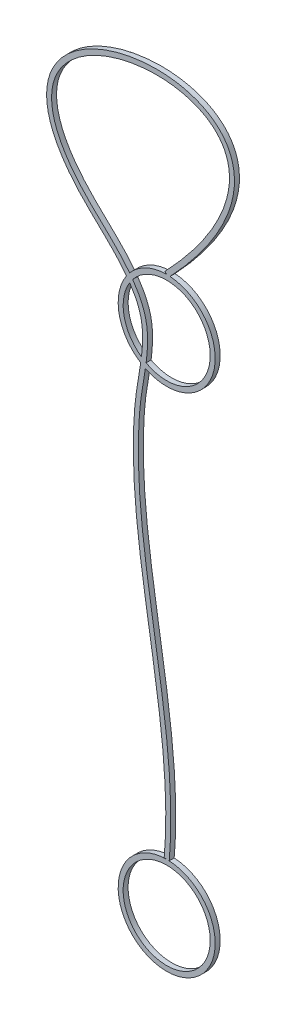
ISO-10303-21;
HEADER;
FILE_DESCRIPTION(('STEP AP214'),'2;1');
FILE_NAME('part.step','',(''),(''),'','','');
FILE_SCHEMA(('AUTOMOTIVE_DESIGN { 1 0 10303 214 1 1 1 1 }'));
ENDSEC;
DATA;
#1=APPLICATION_CONTEXT('core data for automotive mechanical design processes');
#2=APPLICATION_PROTOCOL_DEFINITION('international standard','automotive_design',2000,#1);
#3=PRODUCT_CONTEXT('',#1,'mechanical');
#4=PRODUCT('Part','Part','',(#3));
#5=PRODUCT_RELATED_PRODUCT_CATEGORY('part','',(#4));
#6=PRODUCT_DEFINITION_FORMATION('','',#4);
#7=PRODUCT_DEFINITION_CONTEXT('part definition',#1,'design');
#8=PRODUCT_DEFINITION('design','',#6,#7);
#9=PRODUCT_DEFINITION_SHAPE('','',#8);
#10=(LENGTH_UNIT() NAMED_UNIT(*) SI_UNIT(.MILLI.,.METRE.));
#11=(NAMED_UNIT(*) PLANE_ANGLE_UNIT() SI_UNIT($,.RADIAN.));
#12=(NAMED_UNIT(*) SI_UNIT($,.STERADIAN.) SOLID_ANGLE_UNIT());
#13=UNCERTAINTY_MEASURE_WITH_UNIT(LENGTH_MEASURE(1.E-05),#10,'distance_accuracy_value','');
#14=(GEOMETRIC_REPRESENTATION_CONTEXT(3) GLOBAL_UNCERTAINTY_ASSIGNED_CONTEXT((#13)) GLOBAL_UNIT_ASSIGNED_CONTEXT((#10,
#11,#12)) REPRESENTATION_CONTEXT('',''));
#15=CARTESIAN_POINT('',(0.,0.,0.));
#16=DIRECTION('',(0.,0.,1.));
#17=DIRECTION('',(1.,0.,0.));
#18=AXIS2_PLACEMENT_3D('',#15,#16,#17);
#19=CARTESIAN_POINT('',(-0.362690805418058,111.675423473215,0.5));
#20=CARTESIAN_POINT('',(4.5755259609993,116.879327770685,0.5));
#21=CARTESIAN_POINT('',(7.90134615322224,121.415668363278,0.5));
#22=CARTESIAN_POINT('',(10.9633305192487,127.254228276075,0.5));
#23=CARTESIAN_POINT('',(11.6629688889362,129.039011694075,0.5));
#24=CARTESIAN_POINT('',(12.5090141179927,132.290513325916,0.5));
#25=CARTESIAN_POINT('',(12.6556241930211,133.756632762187,0.5));
#26=CARTESIAN_POINT('',(12.4918650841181,136.385693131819,0.5));
#27=CARTESIAN_POINT('',(12.1825700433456,137.549070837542,0.5));
#28=CARTESIAN_POINT('',(11.1908159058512,139.608892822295,0.5));
#29=CARTESIAN_POINT('',(10.5074357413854,140.506582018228,0.5));
#30=CARTESIAN_POINT('',(8.82664482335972,142.05791487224,0.5));
#31=CARTESIAN_POINT('',(7.82864281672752,142.710770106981,0.5));
#32=CARTESIAN_POINT('',(5.58846655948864,143.772554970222,0.5));
#33=CARTESIAN_POINT('',(4.34662931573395,144.181142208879,0.5));
#34=CARTESIAN_POINT('',(0.377793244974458,145.043573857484,0.5));
#35=CARTESIAN_POINT('',(-2.59188623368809,145.132899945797,0.5));
#36=CARTESIAN_POINT('',(-8.5094384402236,144.402679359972,0.5));
#37=CARTESIAN_POINT('',(-11.4571166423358,143.583517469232,0.5));
#38=CARTESIAN_POINT('',(-16.6665623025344,141.130240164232,0.5));
#39=CARTESIAN_POINT('',(-18.9257149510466,139.49652964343,0.5));
#40=CARTESIAN_POINT('',(-21.3261706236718,136.528081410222,0.5));
#41=CARTESIAN_POINT('',(-21.9624799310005,135.452809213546,0.5));
#42=CARTESIAN_POINT('',(-22.8394842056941,133.137253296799,0.5));
#43=CARTESIAN_POINT('',(-23.0809554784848,131.896694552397,0.5));
#44=CARTESIAN_POINT('',(-23.0940283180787,129.241085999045,0.5));
#45=CARTESIAN_POINT('',(-22.8652479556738,127.825166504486,0.5));
#46=CARTESIAN_POINT('',(-21.8447508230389,124.814946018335,0.5));
#47=CARTESIAN_POINT('',(-21.0525203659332,123.220963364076,0.5));
#48=CARTESIAN_POINT('',(-19.3730158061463,120.705822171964,0.5));
#49=CARTESIAN_POINT('',(-18.7313818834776,119.84681866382,0.5));
#50=CARTESIAN_POINT('',(-17.2738166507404,118.089490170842,0.5));
#51=CARTESIAN_POINT('',(-16.4580346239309,117.19233878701,0.5));
#52=CARTESIAN_POINT('',(-13.7324865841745,114.437000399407,0.5));
#53=CARTESIAN_POINT('',(-11.5603170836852,112.503671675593,0.5));
#54=CARTESIAN_POINT('',(-8.59422053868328,109.33611634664,0.5));
#55=CARTESIAN_POINT('',(-7.65390124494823,108.234961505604,0.5));
#56=CARTESIAN_POINT('',(-6.00874558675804,105.914326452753,0.5));
#57=CARTESIAN_POINT('',(-5.30361505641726,104.694419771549,0.5));
#58=CARTESIAN_POINT('',(-4.53311754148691,102.755023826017,0.5));
#59=CARTESIAN_POINT('',(-4.32443108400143,102.089133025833,0.5));
#60=CARTESIAN_POINT('',(-4.02190992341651,100.724968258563,0.5));
#61=CARTESIAN_POINT('',(-3.92624684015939,100.029568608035,0.5));
#62=CARTESIAN_POINT('',(-3.77070529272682,97.9151951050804,0.5));
#63=CARTESIAN_POINT('',(-3.84176279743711,96.4680727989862,0.5));
#64=CARTESIAN_POINT('',(-4.15351897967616,93.5479187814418,0.5));
#65=CARTESIAN_POINT('',(-4.39447517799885,92.0745139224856,0.5));
#66=CARTESIAN_POINT('',(-4.75575277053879,89.8825860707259,0.5));
#67=CARTESIAN_POINT('',(-4.87619758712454,89.1550188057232,0.5));
#68=CARTESIAN_POINT('',(-5.09630377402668,87.7129899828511,0.5));
#69=CARTESIAN_POINT('',(-5.19499988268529,87.0000044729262,0.5));
#70=CARTESIAN_POINT('',(-5.43625822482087,84.8800855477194,0.5));
#71=CARTESIAN_POINT('',(-5.53362755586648,83.4843742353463,0.5));
#72=CARTESIAN_POINT('',(-5.66401469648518,80.6781517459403,0.5));
#73=CARTESIAN_POINT('',(-5.6931630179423,79.2727888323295,0.5));
#74=CARTESIAN_POINT('',(-5.67073204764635,66.6060838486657,0.5));
#75=CARTESIAN_POINT('',(-3.62213867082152,55.2149635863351,0.5));
#76=CARTESIAN_POINT('',(-0.0264938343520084,32.4114672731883,0.5));
#77=CARTESIAN_POINT('',(1.520885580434,20.9972819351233,0.5));
#78=CARTESIAN_POINT('',(0.497967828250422,9.68621621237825,0.5));
#79=B_SPLINE_CURVE_WITH_KNOTS('',3,(#19,#20,#21,#22,#23,#24,#25,#26,#27,#28,#29,#30,#31,#32,#33,
#34,#35,#36,#37,#38,#39,#40,#41,#42,#43,#44,#45,#46,#47,#48,#49,#50,#51,#52,#53,#54,#55,#56,#57,
#58,#59,#60,#61,#62,#63,#64,#65,#66,#67,#68,#69,#70,#71,#72,#73,#74,#75,#76,#77,#78),
.UNSPECIFIED.,.F.,.F.,(4,2,2,2,2,2,2,2,2,2,2,2,2,2,2,2,2,2,2,2,2,2,2,2,2,2,2,2,2,4),(0.,
0.0625000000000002,0.09375,0.125,0.15625,0.1875,0.21875,0.25,0.3125,0.374999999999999,
0.437499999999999,0.46875,0.5,0.53125,0.5625,0.578125,0.59375,0.625,0.640625,0.65625,0.6640625,
0.671875,0.6875,0.703125,0.7109375,0.71875,0.734374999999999,0.749999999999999,0.875,1.),.UNSPECIFIED.);
#80=DIRECTION('',(0.,0.,-1.));
#81=VECTOR('',#80,1.);
#82=SURFACE_OF_LINEAR_EXTRUSION('',#79,#81);
#83=CARTESIAN_POINT('',(-0.362690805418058,111.675423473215,0.5));
#84=VERTEX_POINT('',#83);
#85=CARTESIAN_POINT('',(-7.43042290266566,107.883792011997,0.5));
#86=VERTEX_POINT('',#85);
#87=EDGE_CURVE('E309',#84,#86,#79,.T.);
#88=ORIENTED_EDGE('',*,*,#87,.T.);
#89=DIRECTION('',(0.,0.,-1.));
#90=VECTOR('',#89,1.);
#91=CARTESIAN_POINT('',(-7.43042290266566,107.883792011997,0.5));
#92=LINE('',#91,#90);
#93=CARTESIAN_POINT('',(-7.43042290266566,107.883792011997,-0.5));
#94=VERTEX_POINT('',#93);
#95=EDGE_CURVE('E277',#86,#94,#92,.T.);
#96=ORIENTED_EDGE('',*,*,#95,.T.);
#97=CARTESIAN_POINT('',(-0.362690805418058,111.675423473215,-0.5));
#98=CARTESIAN_POINT('',(4.5755259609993,116.879327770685,-0.5));
#99=CARTESIAN_POINT('',(7.90134615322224,121.415668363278,-0.5));
#100=CARTESIAN_POINT('',(10.9633305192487,127.254228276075,-0.5));
#101=CARTESIAN_POINT('',(11.6629688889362,129.039011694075,-0.5));
#102=CARTESIAN_POINT('',(12.5090141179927,132.290513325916,-0.5));
#103=CARTESIAN_POINT('',(12.6556241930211,133.756632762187,-0.5));
#104=CARTESIAN_POINT('',(12.4918650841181,136.385693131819,-0.5));
#105=CARTESIAN_POINT('',(12.1825700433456,137.549070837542,-0.5));
#106=CARTESIAN_POINT('',(11.1908159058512,139.608892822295,-0.5));
#107=CARTESIAN_POINT('',(10.5074357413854,140.506582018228,-0.5));
#108=CARTESIAN_POINT('',(8.82664482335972,142.05791487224,-0.5));
#109=CARTESIAN_POINT('',(7.82864281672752,142.710770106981,-0.5));
#110=CARTESIAN_POINT('',(5.58846655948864,143.772554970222,-0.5));
#111=CARTESIAN_POINT('',(4.34662931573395,144.181142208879,-0.5));
#112=CARTESIAN_POINT('',(0.377793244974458,145.043573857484,-0.5));
#113=CARTESIAN_POINT('',(-2.59188623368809,145.132899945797,-0.5));
#114=CARTESIAN_POINT('',(-8.5094384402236,144.402679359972,-0.5));
#115=CARTESIAN_POINT('',(-11.4571166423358,143.583517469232,-0.5));
#116=CARTESIAN_POINT('',(-16.6665623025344,141.130240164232,-0.5));
#117=CARTESIAN_POINT('',(-18.9257149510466,139.49652964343,-0.5));
#118=CARTESIAN_POINT('',(-21.3261706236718,136.528081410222,-0.5));
#119=CARTESIAN_POINT('',(-21.9624799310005,135.452809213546,-0.5));
#120=CARTESIAN_POINT('',(-22.8394842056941,133.137253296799,-0.5));
#121=CARTESIAN_POINT('',(-23.0809554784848,131.896694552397,-0.5));
#122=CARTESIAN_POINT('',(-23.0940283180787,129.241085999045,-0.5));
#123=CARTESIAN_POINT('',(-22.8652479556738,127.825166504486,-0.5));
#124=CARTESIAN_POINT('',(-21.8447508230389,124.814946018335,-0.5));
#125=CARTESIAN_POINT('',(-21.0525203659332,123.220963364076,-0.5));
#126=CARTESIAN_POINT('',(-19.3730158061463,120.705822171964,-0.5));
#127=CARTESIAN_POINT('',(-18.7313818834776,119.84681866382,-0.5));
#128=CARTESIAN_POINT('',(-17.2738166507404,118.089490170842,-0.5));
#129=CARTESIAN_POINT('',(-16.4580346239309,117.19233878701,-0.5));
#130=CARTESIAN_POINT('',(-13.7324865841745,114.437000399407,-0.5));
#131=CARTESIAN_POINT('',(-11.5603170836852,112.503671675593,-0.5));
#132=CARTESIAN_POINT('',(-8.59422053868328,109.33611634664,-0.5));
#133=CARTESIAN_POINT('',(-7.65390124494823,108.234961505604,-0.5));
#134=CARTESIAN_POINT('',(-6.00874558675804,105.914326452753,-0.5));
#135=CARTESIAN_POINT('',(-5.30361505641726,104.694419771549,-0.5));
#136=CARTESIAN_POINT('',(-4.53311754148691,102.755023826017,-0.5));
#137=CARTESIAN_POINT('',(-4.32443108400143,102.089133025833,-0.5));
#138=CARTESIAN_POINT('',(-4.02190992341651,100.724968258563,-0.5));
#139=CARTESIAN_POINT('',(-3.92624684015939,100.029568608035,-0.5));
#140=CARTESIAN_POINT('',(-3.77070529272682,97.9151951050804,-0.5));
#141=CARTESIAN_POINT('',(-3.84176279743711,96.4680727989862,-0.5));
#142=CARTESIAN_POINT('',(-4.15351897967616,93.5479187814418,-0.5));
#143=CARTESIAN_POINT('',(-4.39447517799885,92.0745139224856,-0.5));
#144=CARTESIAN_POINT('',(-4.75575277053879,89.8825860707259,-0.5));
#145=CARTESIAN_POINT('',(-4.87619758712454,89.1550188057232,-0.5));
#146=CARTESIAN_POINT('',(-5.09630377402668,87.7129899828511,-0.5));
#147=CARTESIAN_POINT('',(-5.19499988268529,87.0000044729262,-0.5));
#148=CARTESIAN_POINT('',(-5.43625822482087,84.8800855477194,-0.5));
#149=CARTESIAN_POINT('',(-5.53362755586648,83.4843742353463,-0.5));
#150=CARTESIAN_POINT('',(-5.66401469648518,80.6781517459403,-0.5));
#151=CARTESIAN_POINT('',(-5.6931630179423,79.2727888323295,-0.5));
#152=CARTESIAN_POINT('',(-5.67073204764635,66.6060838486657,-0.5));
#153=CARTESIAN_POINT('',(-3.62213867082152,55.2149635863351,-0.5));
#154=CARTESIAN_POINT('',(-0.0264938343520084,32.4114672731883,-0.5));
#155=CARTESIAN_POINT('',(1.520885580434,20.9972819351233,-0.5));
#156=CARTESIAN_POINT('',(0.497967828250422,9.68621621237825,-0.5));
#157=B_SPLINE_CURVE_WITH_KNOTS('',3,(#97,#98,#99,#100,#101,#102,#103,#104,#105,#106,#107,#108,
#109,#110,#111,#112,#113,#114,#115,#116,#117,#118,#119,#120,#121,#122,#123,#124,#125,#126,#127,
#128,#129,#130,#131,#132,#133,#134,#135,#136,#137,#138,#139,#140,#141,#142,#143,#144,#145,#146,
#147,#148,#149,#150,#151,#152,#153,#154,#155,#156),.UNSPECIFIED.,.F.,.F.,(4,2,2,2,2,2,2,2,2,2,2,
2,2,2,2,2,2,2,2,2,2,2,2,2,2,2,2,2,2,4),(0.,0.0625000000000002,0.09375,0.125,0.15625,0.1875,
0.21875,0.25,0.3125,0.374999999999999,0.437499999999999,0.46875,0.5,0.53125,0.5625,0.578125,
0.59375,0.625,0.640625,0.65625,0.6640625,0.671875,0.6875,0.703125,0.7109375,0.71875,
0.734374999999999,0.749999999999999,0.875,1.),.UNSPECIFIED.);
#158=CARTESIAN_POINT('',(-0.362690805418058,111.675423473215,-0.5));
#159=VERTEX_POINT('',#158);
#160=EDGE_CURVE('E196',#159,#94,#157,.T.);
#161=ORIENTED_EDGE('',*,*,#160,.F.);
#162=DIRECTION('',(0.,0.,-1.));
#163=VECTOR('',#162,1.);
#164=CARTESIAN_POINT('',(-0.362690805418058,111.675423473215,0.5));
#165=LINE('',#164,#163);
#166=EDGE_CURVE('E210',#84,#159,#165,.T.);
#167=ORIENTED_EDGE('',*,*,#166,.F.);
#168=EDGE_LOOP('',(#88,#96,#161,#167));
#169=FACE_BOUND('',#168,.T.);
#170=ADVANCED_FACE('F36',(#169),#82,.T.);
#171=CARTESIAN_POINT('',(-4.27742101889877,92.85923939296,-0.5));
#172=VERTEX_POINT('',#171);
#173=CARTESIAN_POINT('',(0.500867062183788,9.71835164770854,-0.5));
#174=VERTEX_POINT('',#173);
#175=EDGE_CURVE('E205',#172,#174,#157,.T.);
#176=ORIENTED_EDGE('',*,*,#175,.F.);
#177=DIRECTION('',(0.,0.,-1.));
#178=VECTOR('',#177,1.);
#179=CARTESIAN_POINT('',(-4.27742101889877,92.85923939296,0.5));
#180=LINE('',#179,#178);
#181=CARTESIAN_POINT('',(-4.27742101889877,92.85923939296,0.5));
#182=VERTEX_POINT('',#181);
#183=EDGE_CURVE('E54',#172,#182,#180,.F.);
#184=ORIENTED_EDGE('',*,*,#183,.T.);
#185=CARTESIAN_POINT('',(0.500867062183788,9.71835164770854,0.5));
#186=VERTEX_POINT('',#185);
#187=EDGE_CURVE('E170',#182,#186,#79,.T.);
#188=ORIENTED_EDGE('',*,*,#187,.T.);
#189=DIRECTION('',(0.,0.,-1.));
#190=VECTOR('',#189,1.);
#191=CARTESIAN_POINT('',(0.500867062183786,9.71835164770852,0.5));
#192=LINE('',#191,#190);
#193=EDGE_CURVE('E228',#174,#186,#192,.F.);
#194=ORIENTED_EDGE('',*,*,#193,.F.);
#195=EDGE_LOOP('',(#176,#184,#188,#194));
#196=FACE_BOUND('',#195,.T.);
#197=ADVANCED_FACE('F324',(#196),#82,.T.);
#198=CARTESIAN_POINT('',(0.362690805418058,110.987076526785,0.5));
#199=CARTESIAN_POINT('',(5.34622723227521,116.23873878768,0.5));
#200=CARTESIAN_POINT('',(8.72802714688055,120.838873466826,0.5));
#201=CARTESIAN_POINT('',(11.8783919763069,126.845956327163,0.5));
#202=CARTESIAN_POINT('',(12.6080231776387,128.699875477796,0.5));
#203=CARTESIAN_POINT('',(13.4995098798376,132.126016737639,0.5));
#204=CARTESIAN_POINT('',(13.6611621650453,133.698837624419,0.5));
#205=CARTESIAN_POINT('',(13.4824585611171,136.567823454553,0.5));
#206=CARTESIAN_POINT('',(13.1410285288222,137.863551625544,0.5));
#207=CARTESIAN_POINT('',(12.0343648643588,140.162034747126,0.5));
#208=CARTESIAN_POINT('',(11.2700522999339,141.163544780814,0.5));
#209=CARTESIAN_POINT('',(9.42050988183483,142.870631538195,0.5));
#210=CARTESIAN_POINT('',(8.33587128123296,143.576996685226,0.5));
#211=CARTESIAN_POINT('',(5.93783822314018,144.713601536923,0.5));
#212=CARTESIAN_POINT('',(4.6241067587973,145.144183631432,0.5));
#213=CARTESIAN_POINT('',(0.459874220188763,146.049075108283,0.5));
#214=CARTESIAN_POINT('',(-2.61430868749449,146.137717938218,0.5));
#215=CARTESIAN_POINT('',(-8.73195632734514,145.382805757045,0.5));
#216=CARTESIAN_POINT('',(-11.7756155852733,144.538865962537,0.5));
#217=CARTESIAN_POINT('',(-17.2001616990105,141.984291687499,0.5));
#218=CARTESIAN_POINT('',(-19.5836633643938,140.27325231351,0.5));
#219=CARTESIAN_POINT('',(-22.1635581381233,137.082906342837,0.5));
#220=CARTESIAN_POINT('',(-22.8567604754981,135.91496891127,0.5));
#221=CARTESIAN_POINT('',(-23.8155493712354,133.383476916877,0.5));
#222=CARTESIAN_POINT('',(-24.0803596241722,132.020197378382,0.5));
#223=CARTESIAN_POINT('',(-24.0945999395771,129.12742851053,0.5));
#224=CARTESIAN_POINT('',(-23.8444119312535,127.598808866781,0.5));
#225=CARTESIAN_POINT('',(-22.7597026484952,124.399178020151,0.5));
#226=CARTESIAN_POINT('',(-21.9256950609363,122.727848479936,0.5));
#227=CARTESIAN_POINT('',(-20.1838754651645,120.119387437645,0.5));
#228=CARTESIAN_POINT('',(-19.52140682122,119.232917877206,0.5));
#229=CARTESIAN_POINT('',(-18.0231920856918,117.426579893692,0.5));
#230=CARTESIAN_POINT('',(-17.1855183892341,116.505810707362,0.5));
#231=CARTESIAN_POINT('',(-14.4103379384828,113.700297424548,0.5));
#232=CARTESIAN_POINT('',(-12.2483446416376,111.775401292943,0.5));
#233=CARTESIAN_POINT('',(-9.34511371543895,108.674981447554,0.5));
#234=CARTESIAN_POINT('',(-8.43430997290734,107.606704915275,0.5));
#235=CARTESIAN_POINT('',(-6.85993053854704,105.385905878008,0.5));
#236=CARTESIAN_POINT('',(-6.19664901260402,104.23380984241,0.5));
#237=CARTESIAN_POINT('',(-5.4806157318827,102.431504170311,0.5));
#238=CARTESIAN_POINT('',(-5.28889909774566,101.819357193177,0.5));
#239=CARTESIAN_POINT('',(-5.01000575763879,100.561737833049,0.5));
#240=CARTESIAN_POINT('',(-4.92047851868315,99.9144238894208,0.5));
#241=CARTESIAN_POINT('',(-4.77415726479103,97.9253876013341,0.5));
#242=CARTESIAN_POINT('',(-4.84013544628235,96.5365447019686,0.5));
#243=CARTESIAN_POINT('',(-5.14384510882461,93.6917607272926,0.5));
#244=CARTESIAN_POINT('',(-5.38131906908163,92.2361927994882,0.5));
#245=CARTESIAN_POINT('',(-5.86270976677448,89.3155198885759,0.5));
#246=CARTESIAN_POINT('',(-6.104890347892,87.8485098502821,0.5));
#247=CARTESIAN_POINT('',(-6.43312109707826,84.9643709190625,0.5));
#248=CARTESIAN_POINT('',(-6.53175439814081,83.547908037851,0.5));
#249=CARTESIAN_POINT('',(-6.66373247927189,80.7074449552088,0.5));
#250=CARTESIAN_POINT('',(-6.69318798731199,79.2860035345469,0.5));
#251=CARTESIAN_POINT('',(-6.67051818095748,66.4844285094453,0.5));
#252=CARTESIAN_POINT('',(-4.6076602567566,55.0447860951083,0.5));
#253=CARTESIAN_POINT('',(-1.01656362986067,32.2701344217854,0.5));
#254=CARTESIAN_POINT('',(0.511347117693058,20.9369344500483,0.5));
#255=CARTESIAN_POINT('',(-0.497967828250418,9.77628378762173,0.5));
#256=B_SPLINE_CURVE_WITH_KNOTS('',3,(#198,#199,#200,#201,#202,#203,#204,#205,#206,#207,#208,
#209,#210,#211,#212,#213,#214,#215,#216,#217,#218,#219,#220,#221,#222,#223,#224,#225,#226,#227,
#228,#229,#230,#231,#232,#233,#234,#235,#236,#237,#238,#239,#240,#241,#242,#243,#244,#245,#246,
#247,#248,#249,#250,#251,#252,#253,#254,#255),.UNSPECIFIED.,.F.,.F.,(4,2,2,2,2,2,2,2,2,2,2,2,2,
2,2,2,2,2,2,2,2,2,2,2,2,2,2,2,4),(0.,0.0625000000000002,0.0937500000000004,0.125,
0.156250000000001,0.187500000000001,0.218750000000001,0.250000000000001,0.312500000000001,
0.375000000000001,0.437500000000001,0.468750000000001,0.500000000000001,0.531250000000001,
0.562500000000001,0.578125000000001,0.593750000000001,0.625000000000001,0.640625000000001,
0.656250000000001,0.664062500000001,0.671875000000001,0.687500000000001,0.703125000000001,
0.718750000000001,0.734375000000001,0.750000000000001,0.875000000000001,1.),.UNSPECIFIED.);
#257=DIRECTION('',(0.,0.,-1.));
#258=VECTOR('',#257,1.);
#259=SURFACE_OF_LINEAR_EXTRUSION('',#256,#258);
#260=DIRECTION('',(0.,0.,-1.));
#261=VECTOR('',#260,1.);
#262=CARTESIAN_POINT('',(0.666383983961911,111.308406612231,0.5));
#263=LINE('',#262,#261);
#264=CARTESIAN_POINT('',(0.666383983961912,111.308406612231,-0.5));
#265=VERTEX_POINT('',#264);
#266=CARTESIAN_POINT('',(0.666383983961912,111.308406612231,0.5));
#267=VERTEX_POINT('',#266);
#268=EDGE_CURVE('E151',#265,#267,#263,.F.);
#269=ORIENTED_EDGE('',*,*,#268,.F.);
#270=CARTESIAN_POINT('',(0.362690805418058,110.987076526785,-0.5));
#271=CARTESIAN_POINT('',(5.34622723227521,116.23873878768,-0.5));
#272=CARTESIAN_POINT('',(8.72802714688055,120.838873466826,-0.5));
#273=CARTESIAN_POINT('',(11.8783919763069,126.845956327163,-0.5));
#274=CARTESIAN_POINT('',(12.6080231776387,128.699875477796,-0.5));
#275=CARTESIAN_POINT('',(13.4995098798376,132.126016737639,-0.5));
#276=CARTESIAN_POINT('',(13.6611621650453,133.698837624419,-0.5));
#277=CARTESIAN_POINT('',(13.4824585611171,136.567823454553,-0.5));
#278=CARTESIAN_POINT('',(13.1410285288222,137.863551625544,-0.5));
#279=CARTESIAN_POINT('',(12.0343648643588,140.162034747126,-0.5));
#280=CARTESIAN_POINT('',(11.2700522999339,141.163544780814,-0.5));
#281=CARTESIAN_POINT('',(9.42050988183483,142.870631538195,-0.5));
#282=CARTESIAN_POINT('',(8.33587128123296,143.576996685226,-0.5));
#283=CARTESIAN_POINT('',(5.93783822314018,144.713601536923,-0.5));
#284=CARTESIAN_POINT('',(4.6241067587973,145.144183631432,-0.5));
#285=CARTESIAN_POINT('',(0.459874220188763,146.049075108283,-0.5));
#286=CARTESIAN_POINT('',(-2.61430868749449,146.137717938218,-0.5));
#287=CARTESIAN_POINT('',(-8.73195632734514,145.382805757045,-0.5));
#288=CARTESIAN_POINT('',(-11.7756155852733,144.538865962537,-0.5));
#289=CARTESIAN_POINT('',(-17.2001616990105,141.984291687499,-0.5));
#290=CARTESIAN_POINT('',(-19.5836633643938,140.27325231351,-0.5));
#291=CARTESIAN_POINT('',(-22.1635581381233,137.082906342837,-0.5));
#292=CARTESIAN_POINT('',(-22.8567604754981,135.91496891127,-0.5));
#293=CARTESIAN_POINT('',(-23.8155493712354,133.383476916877,-0.5));
#294=CARTESIAN_POINT('',(-24.0803596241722,132.020197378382,-0.5));
#295=CARTESIAN_POINT('',(-24.0945999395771,129.12742851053,-0.5));
#296=CARTESIAN_POINT('',(-23.8444119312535,127.598808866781,-0.5));
#297=CARTESIAN_POINT('',(-22.7597026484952,124.399178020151,-0.5));
#298=CARTESIAN_POINT('',(-21.9256950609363,122.727848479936,-0.5));
#299=CARTESIAN_POINT('',(-20.1838754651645,120.119387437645,-0.5));
#300=CARTESIAN_POINT('',(-19.52140682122,119.232917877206,-0.5));
#301=CARTESIAN_POINT('',(-18.0231920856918,117.426579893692,-0.5));
#302=CARTESIAN_POINT('',(-17.1855183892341,116.505810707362,-0.5));
#303=CARTESIAN_POINT('',(-14.4103379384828,113.700297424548,-0.5));
#304=CARTESIAN_POINT('',(-12.2483446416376,111.775401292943,-0.5));
#305=CARTESIAN_POINT('',(-9.34511371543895,108.674981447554,-0.5));
#306=CARTESIAN_POINT('',(-8.43430997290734,107.606704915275,-0.5));
#307=CARTESIAN_POINT('',(-6.85993053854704,105.385905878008,-0.5));
#308=CARTESIAN_POINT('',(-6.19664901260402,104.23380984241,-0.5));
#309=CARTESIAN_POINT('',(-5.4806157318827,102.431504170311,-0.5));
#310=CARTESIAN_POINT('',(-5.28889909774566,101.819357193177,-0.5));
#311=CARTESIAN_POINT('',(-5.01000575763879,100.561737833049,-0.5));
#312=CARTESIAN_POINT('',(-4.92047851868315,99.9144238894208,-0.5));
#313=CARTESIAN_POINT('',(-4.77415726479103,97.9253876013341,-0.5));
#314=CARTESIAN_POINT('',(-4.84013544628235,96.5365447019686,-0.5));
#315=CARTESIAN_POINT('',(-5.14384510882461,93.6917607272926,-0.5));
#316=CARTESIAN_POINT('',(-5.38131906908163,92.2361927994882,-0.5));
#317=CARTESIAN_POINT('',(-5.86270976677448,89.3155198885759,-0.5));
#318=CARTESIAN_POINT('',(-6.104890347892,87.8485098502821,-0.5));
#319=CARTESIAN_POINT('',(-6.43312109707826,84.9643709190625,-0.5));
#320=CARTESIAN_POINT('',(-6.53175439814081,83.547908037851,-0.5));
#321=CARTESIAN_POINT('',(-6.66373247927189,80.7074449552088,-0.5));
#322=CARTESIAN_POINT('',(-6.69318798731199,79.2860035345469,-0.5));
#323=CARTESIAN_POINT('',(-6.67051818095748,66.4844285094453,-0.5));
#324=CARTESIAN_POINT('',(-4.6076602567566,55.0447860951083,-0.5));
#325=CARTESIAN_POINT('',(-1.01656362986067,32.2701344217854,-0.5));
#326=CARTESIAN_POINT('',(0.511347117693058,20.9369344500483,-0.5));
#327=CARTESIAN_POINT('',(-0.497967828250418,9.77628378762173,-0.5));
#328=B_SPLINE_CURVE_WITH_KNOTS('',3,(#270,#271,#272,#273,#274,#275,#276,#277,#278,#279,#280,
#281,#282,#283,#284,#285,#286,#287,#288,#289,#290,#291,#292,#293,#294,#295,#296,#297,#298,#299,
#300,#301,#302,#303,#304,#305,#306,#307,#308,#309,#310,#311,#312,#313,#314,#315,#316,#317,#318,
#319,#320,#321,#322,#323,#324,#325,#326,#327),.UNSPECIFIED.,.F.,.F.,(4,2,2,2,2,2,2,2,2,2,2,2,2,
2,2,2,2,2,2,2,2,2,2,2,2,2,2,2,4),(0.,0.0625000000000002,0.0937500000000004,0.125,
0.156250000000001,0.187500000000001,0.218750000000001,0.250000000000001,0.312500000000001,
0.375000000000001,0.437500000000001,0.468750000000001,0.500000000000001,0.531250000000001,
0.562500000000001,0.578125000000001,0.593750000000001,0.625000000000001,0.640625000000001,
0.656250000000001,0.664062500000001,0.671875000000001,0.687500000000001,0.703125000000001,
0.718750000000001,0.734375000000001,0.750000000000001,0.875000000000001,1.),.UNSPECIFIED.);
#329=CARTESIAN_POINT('',(-8.05732602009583,107.05680528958,-0.5));
#330=VERTEX_POINT('',#329);
#331=EDGE_CURVE('E286',#265,#330,#328,.T.);
#332=ORIENTED_EDGE('',*,*,#331,.T.);
#333=DIRECTION('',(0.,0.,-1.));
#334=VECTOR('',#333,1.);
#335=CARTESIAN_POINT('',(-8.05732602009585,107.05680528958,0.5));
#336=LINE('',#335,#334);
#337=CARTESIAN_POINT('',(-8.05732602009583,107.05680528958,0.5));
#338=VERTEX_POINT('',#337);
#339=EDGE_CURVE('E161',#338,#330,#336,.T.);
#340=ORIENTED_EDGE('',*,*,#339,.F.);
#341=EDGE_CURVE('E168',#267,#338,#256,.T.);
#342=ORIENTED_EDGE('',*,*,#341,.F.);
#343=EDGE_LOOP('',(#269,#332,#340,#342));
#344=FACE_BOUND('',#343,.T.);
#345=ADVANCED_FACE('F177',(#344),#259,.F.);
#346=DIRECTION('',(0.,0.,-1.));
#347=VECTOR('',#346,1.);
#348=CARTESIAN_POINT('',(-5.21164752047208,93.3819736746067,0.5));
#349=LINE('',#348,#347);
#350=CARTESIAN_POINT('',(-5.21164752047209,93.3819736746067,-0.5));
#351=VERTEX_POINT('',#350);
#352=CARTESIAN_POINT('',(-5.21164752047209,93.3819736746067,0.5));
#353=VERTEX_POINT('',#352);
#354=EDGE_CURVE('E271',#351,#353,#349,.F.);
#355=ORIENTED_EDGE('',*,*,#354,.F.);
#356=CARTESIAN_POINT('',(-0.497967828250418,9.77628378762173,-0.5));
#357=VERTEX_POINT('',#356);
#358=EDGE_CURVE('E281',#351,#357,#328,.T.);
#359=ORIENTED_EDGE('',*,*,#358,.T.);
#360=DIRECTION('',(0.,0.,-1.));
#361=VECTOR('',#360,1.);
#362=CARTESIAN_POINT('',(-0.497967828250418,9.77628378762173,0.5));
#363=LINE('',#362,#361);
#364=CARTESIAN_POINT('',(-0.497967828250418,9.77628378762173,0.5));
#365=VERTEX_POINT('',#364);
#366=EDGE_CURVE('E212',#365,#357,#363,.T.);
#367=ORIENTED_EDGE('',*,*,#366,.F.);
#368=EDGE_CURVE('E181',#353,#365,#256,.T.);
#369=ORIENTED_EDGE('',*,*,#368,.F.);
#370=EDGE_LOOP('',(#355,#359,#367,#369));
#371=FACE_BOUND('',#370,.T.);
#372=ADVANCED_FACE('F333',(#371),#259,.F.);
#373=CARTESIAN_POINT('',(0.362690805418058,110.987076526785,0.5));
#374=DIRECTION('',(-0.688346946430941,-0.725381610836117,0.));
#375=DIRECTION('',(0.725381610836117,-0.688346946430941,0.));
#376=AXIS2_PLACEMENT_3D('',#373,#374,#375);
#377=PLANE('',#376);
#378=DIRECTION('',(-0.725381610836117,0.688346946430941,0.));
#379=VECTOR('',#378,1.);
#380=CARTESIAN_POINT('',(0.362690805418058,110.987076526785,-0.5));
#381=LINE('',#380,#379);
#382=CARTESIAN_POINT('',(0.,111.33125,-0.5));
#383=VERTEX_POINT('',#382);
#384=EDGE_CURVE('E192',#383,#159,#381,.T.);
#385=ORIENTED_EDGE('',*,*,#384,.F.);
#386=DIRECTION('',(0.,0.,-1.));
#387=VECTOR('',#386,1.);
#388=CARTESIAN_POINT('',(0.,111.33125,0.5));
#389=LINE('',#388,#387);
#390=CARTESIAN_POINT('',(0.,111.33125,0.5));
#391=VERTEX_POINT('',#390);
#392=EDGE_CURVE('E239',#383,#391,#389,.F.);
#393=ORIENTED_EDGE('',*,*,#392,.T.);
#394=DIRECTION('',(-0.725381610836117,0.688346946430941,0.));
#395=VECTOR('',#394,1.);
#396=CARTESIAN_POINT('',(0.362690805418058,110.987076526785,0.5));
#397=LINE('',#396,#395);
#398=EDGE_CURVE('E213',#391,#84,#397,.T.);
#399=ORIENTED_EDGE('',*,*,#398,.T.);
#400=ORIENTED_EDGE('',*,*,#166,.T.);
#401=EDGE_LOOP('',(#385,#393,#399,#400));
#402=FACE_BOUND('',#401,.T.);
#403=ADVANCED_FACE('F325',(#402),#377,.T.);
#404=CARTESIAN_POINT('',(0.,0.,0.5));
#405=DIRECTION('',(0.,0.,1.));
#406=DIRECTION('',(1.,0.,0.));
#407=AXIS2_PLACEMENT_3D('',#404,#405,#406);
#408=PLANE('',#407);
#409=CARTESIAN_POINT('',(0.,101.6,0.5));
#410=DIRECTION('',(0.,0.,1.));
#411=DIRECTION('',(1.,0.,0.));
#412=AXIS2_PLACEMENT_3D('',#409,#410,#411);
#413=CIRCLE('',#412,9.73125);
#414=EDGE_CURVE('E175',#391,#86,#413,.T.);
#415=ORIENTED_EDGE('',*,*,#414,.T.);
#416=ORIENTED_EDGE('',*,*,#87,.F.);
#417=ORIENTED_EDGE('',*,*,#398,.F.);
#418=EDGE_LOOP('',(#415,#416,#417));
#419=FACE_BOUND('',#418,.T.);
#420=CARTESIAN_POINT('',(-7.43049434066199,106.185027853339,0.5));
#421=VERTEX_POINT('',#420);
#422=CARTESIAN_POINT('',(-5.0639486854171,94.487254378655,0.5));
#423=VERTEX_POINT('',#422);
#424=EDGE_CURVE('E179',#421,#423,#256,.T.);
#425=ORIENTED_EDGE('',*,*,#424,.T.);
#426=CARTESIAN_POINT('',(0.,101.6,0.5));
#427=DIRECTION('',(0.,0.,1.));
#428=DIRECTION('',(1.,0.,0.));
#429=AXIS2_PLACEMENT_3D('',#426,#427,#428);
#430=CIRCLE('',#429,8.73125);
#431=EDGE_CURVE('E255',#421,#423,#430,.T.);
#432=ORIENTED_EDGE('',*,*,#431,.F.);
#433=EDGE_LOOP('',(#425,#432));
#434=FACE_BOUND('',#433,.T.);
#435=CARTESIAN_POINT('',(-4.12966240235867,93.9071062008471,0.5));
#436=VERTEX_POINT('',#435);
#437=CARTESIAN_POINT('',(-6.81743278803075,107.055028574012,0.5));
#438=VERTEX_POINT('',#437);
#439=EDGE_CURVE('E257',#436,#438,#430,.T.);
#440=ORIENTED_EDGE('',*,*,#439,.F.);
#441=EDGE_CURVE('E307',#438,#436,#79,.T.);
#442=ORIENTED_EDGE('',*,*,#441,.F.);
#443=EDGE_LOOP('',(#440,#442));
#444=FACE_BOUND('',#443,.T.);
#445=EDGE_CURVE('E154',#182,#267,#413,.T.);
#446=ORIENTED_EDGE('',*,*,#445,.T.);
#447=ORIENTED_EDGE('',*,*,#341,.T.);
#448=EDGE_CURVE('E172',#338,#353,#413,.T.);
#449=ORIENTED_EDGE('',*,*,#448,.T.);
#450=ORIENTED_EDGE('',*,*,#368,.T.);
#451=DIRECTION('',(-0.99593565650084,0.0900675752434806,0.));
#452=VECTOR('',#451,1.);
#453=CARTESIAN_POINT('',(0.497967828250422,9.68621621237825,0.5));
#454=LINE('',#453,#452);
#455=CARTESIAN_POINT('',(0.,9.73125,0.5));
#456=VERTEX_POINT('',#455);
#457=EDGE_CURVE('E178',#456,#365,#454,.T.);
#458=ORIENTED_EDGE('',*,*,#457,.F.);
#459=CARTESIAN_POINT('',(0.,0.,0.5));
#460=DIRECTION('',(0.,0.,1.));
#461=DIRECTION('',(1.,0.,0.));
#462=AXIS2_PLACEMENT_3D('',#459,#460,#461);
#463=CIRCLE('',#462,9.73125);
#464=EDGE_CURVE('E225',#456,#186,#463,.T.);
#465=ORIENTED_EDGE('',*,*,#464,.T.);
#466=ORIENTED_EDGE('',*,*,#187,.F.);
#467=EDGE_LOOP('',(#446,#447,#449,#450,#458,#465,#466));
#468=FACE_BOUND('',#467,.T.);
#469=CARTESIAN_POINT('',(0.,0.,0.5));
#470=DIRECTION('',(0.,0.,1.));
#471=DIRECTION('',(1.,0.,0.));
#472=AXIS2_PLACEMENT_3D('',#469,#470,#471);
#473=CIRCLE('',#472,8.73125);
#474=CARTESIAN_POINT('',(8.73125,0.,0.5));
#475=VERTEX_POINT('',#474);
#476=EDGE_CURVE('E217',#475,#475,#473,.T.);
#477=ORIENTED_EDGE('',*,*,#476,.F.);
#478=EDGE_LOOP('',(#477));
#479=FACE_BOUND('',#478,.T.);
#480=ADVANCED_FACE('F165',(#419,#434,#444,#468,#479),#408,.T.);
#481=CARTESIAN_POINT('',(0.,0.,-0.5));
#482=DIRECTION('',(0.,0.,1.));
#483=DIRECTION('',(1.,0.,0.));
#484=AXIS2_PLACEMENT_3D('',#481,#482,#483);
#485=PLANE('',#484);
#486=ORIENTED_EDGE('',*,*,#160,.T.);
#487=CARTESIAN_POINT('',(0.,101.6,-0.5));
#488=DIRECTION('',(0.,0.,1.));
#489=DIRECTION('',(1.,0.,0.));
#490=AXIS2_PLACEMENT_3D('',#487,#488,#489);
#491=CIRCLE('',#490,9.73125);
#492=EDGE_CURVE('E173',#383,#94,#491,.T.);
#493=ORIENTED_EDGE('',*,*,#492,.F.);
#494=ORIENTED_EDGE('',*,*,#384,.T.);
#495=EDGE_LOOP('',(#486,#493,#494));
#496=FACE_BOUND('',#495,.T.);
#497=CARTESIAN_POINT('',(0.,101.6,-0.5));
#498=DIRECTION('',(0.,0.,1.));
#499=DIRECTION('',(1.,0.,0.));
#500=AXIS2_PLACEMENT_3D('',#497,#498,#499);
#501=CIRCLE('',#500,8.73125);
#502=CARTESIAN_POINT('',(-7.430494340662,106.185027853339,-0.5));
#503=VERTEX_POINT('',#502);
#504=CARTESIAN_POINT('',(-5.0639486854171,94.487254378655,-0.5));
#505=VERTEX_POINT('',#504);
#506=EDGE_CURVE('E265',#503,#505,#501,.T.);
#507=ORIENTED_EDGE('',*,*,#506,.T.);
#508=EDGE_CURVE('E249',#503,#505,#328,.T.);
#509=ORIENTED_EDGE('',*,*,#508,.F.);
#510=EDGE_LOOP('',(#507,#509));
#511=FACE_BOUND('',#510,.T.);
#512=CARTESIAN_POINT('',(-6.81743278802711,107.055028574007,-0.5));
#513=VERTEX_POINT('',#512);
#514=CARTESIAN_POINT('',(-4.12966240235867,93.9071062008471,-0.5));
#515=VERTEX_POINT('',#514);
#516=EDGE_CURVE('E203',#513,#515,#157,.T.);
#517=ORIENTED_EDGE('',*,*,#516,.T.);
#518=EDGE_CURVE('E267',#515,#513,#501,.T.);
#519=ORIENTED_EDGE('',*,*,#518,.T.);
#520=EDGE_LOOP('',(#517,#519));
#521=FACE_BOUND('',#520,.T.);
#522=EDGE_CURVE('E261',#330,#351,#491,.T.);
#523=ORIENTED_EDGE('',*,*,#522,.F.);
#524=ORIENTED_EDGE('',*,*,#331,.F.);
#525=EDGE_CURVE('E156',#172,#265,#491,.T.);
#526=ORIENTED_EDGE('',*,*,#525,.F.);
#527=ORIENTED_EDGE('',*,*,#175,.T.);
#528=CARTESIAN_POINT('',(0.,0.,-0.5));
#529=DIRECTION('',(0.,0.,1.));
#530=DIRECTION('',(1.,0.,0.));
#531=AXIS2_PLACEMENT_3D('',#528,#529,#530);
#532=CIRCLE('',#531,9.73125);
#533=CARTESIAN_POINT('',(0.,9.73125,-0.5));
#534=VERTEX_POINT('',#533);
#535=EDGE_CURVE('E221',#534,#174,#532,.T.);
#536=ORIENTED_EDGE('',*,*,#535,.F.);
#537=DIRECTION('',(-0.99593565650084,0.0900675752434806,0.));
#538=VECTOR('',#537,1.);
#539=CARTESIAN_POINT('',(0.497967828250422,9.68621621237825,-0.5));
#540=LINE('',#539,#538);
#541=EDGE_CURVE('E297',#534,#357,#540,.T.);
#542=ORIENTED_EDGE('',*,*,#541,.T.);
#543=ORIENTED_EDGE('',*,*,#358,.F.);
#544=EDGE_LOOP('',(#523,#524,#526,#527,#536,#542,#543));
#545=FACE_BOUND('',#544,.T.);
#546=CARTESIAN_POINT('',(0.,0.,-0.5));
#547=DIRECTION('',(0.,0.,1.));
#548=DIRECTION('',(1.,0.,0.));
#549=AXIS2_PLACEMENT_3D('',#546,#547,#548);
#550=CIRCLE('',#549,8.73125);
#551=CARTESIAN_POINT('',(8.73125,0.,-0.5));
#552=VERTEX_POINT('',#551);
#553=EDGE_CURVE('E216',#552,#552,#550,.T.);
#554=ORIENTED_EDGE('',*,*,#553,.T.);
#555=EDGE_LOOP('',(#554));
#556=FACE_BOUND('',#555,.T.);
#557=ADVANCED_FACE('F304',(#496,#511,#521,#545,#556),#485,.F.);
#558=CARTESIAN_POINT('',(0.,0.,0.5));
#559=DIRECTION('',(0.,0.,-1.));
#560=DIRECTION('',(-1.,0.,0.));
#561=AXIS2_PLACEMENT_3D('',#558,#559,#560);
#562=CYLINDRICAL_SURFACE('',#561,9.73125);
#563=ORIENTED_EDGE('',*,*,#464,.F.);
#564=DIRECTION('',(0.,0.,-1.));
#565=VECTOR('',#564,1.);
#566=CARTESIAN_POINT('',(0.,9.73125,0.5));
#567=LINE('',#566,#565);
#568=EDGE_CURVE('E235',#456,#534,#567,.T.);
#569=ORIENTED_EDGE('',*,*,#568,.T.);
#570=ORIENTED_EDGE('',*,*,#535,.T.);
#571=ORIENTED_EDGE('',*,*,#193,.T.);
#572=EDGE_LOOP('',(#563,#569,#570,#571));
#573=FACE_BOUND('',#572,.T.);
#574=ADVANCED_FACE('F38',(#573),#562,.T.);
#575=CARTESIAN_POINT('',(0.,0.,0.5));
#576=DIRECTION('',(0.,0.,-1.));
#577=DIRECTION('',(-1.,0.,0.));
#578=AXIS2_PLACEMENT_3D('',#575,#576,#577);
#579=CYLINDRICAL_SURFACE('',#578,8.73125);
#580=ORIENTED_EDGE('',*,*,#476,.T.);
#581=EDGE_LOOP('',(#580));
#582=FACE_BOUND('',#581,.T.);
#583=ORIENTED_EDGE('',*,*,#553,.F.);
#584=EDGE_LOOP('',(#583));
#585=FACE_BOUND('',#584,.T.);
#586=ADVANCED_FACE('F329',(#582,#585),#579,.F.);
#587=CARTESIAN_POINT('',(0.497967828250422,9.68621621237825,0.5));
#588=DIRECTION('',(-0.0900675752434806,-0.99593565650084,0.));
#589=DIRECTION('',(0.99593565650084,-0.0900675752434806,0.));
#590=AXIS2_PLACEMENT_3D('',#587,#588,#589);
#591=PLANE('',#590);
#592=ORIENTED_EDGE('',*,*,#568,.F.);
#593=ORIENTED_EDGE('',*,*,#457,.T.);
#594=ORIENTED_EDGE('',*,*,#366,.T.);
#595=ORIENTED_EDGE('',*,*,#541,.F.);
#596=EDGE_LOOP('',(#592,#593,#594,#595));
#597=FACE_BOUND('',#596,.T.);
#598=ADVANCED_FACE('F323',(#597),#591,.T.);
#599=DIRECTION('',(0.,0.,-1.));
#600=VECTOR('',#599,1.);
#601=CARTESIAN_POINT('',(-6.81743278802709,107.055028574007,0.5));
#602=LINE('',#601,#600);
#603=EDGE_CURVE('E62',#438,#513,#602,.T.);
#604=ORIENTED_EDGE('',*,*,#603,.F.);
#605=ORIENTED_EDGE('',*,*,#441,.T.);
#606=DIRECTION('',(0.,0.,-1.));
#607=VECTOR('',#606,1.);
#608=CARTESIAN_POINT('',(-4.12966240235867,93.9071062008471,0.5));
#609=LINE('',#608,#607);
#610=EDGE_CURVE('E279',#515,#436,#609,.F.);
#611=ORIENTED_EDGE('',*,*,#610,.F.);
#612=ORIENTED_EDGE('',*,*,#516,.F.);
#613=EDGE_LOOP('',(#604,#605,#611,#612));
#614=FACE_BOUND('',#613,.T.);
#615=ADVANCED_FACE('F319',(#614),#82,.T.);
#616=ORIENTED_EDGE('',*,*,#424,.F.);
#617=DIRECTION('',(0.,0.,-1.));
#618=VECTOR('',#617,1.);
#619=CARTESIAN_POINT('',(-7.430494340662,106.185027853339,0.5));
#620=LINE('',#619,#618);
#621=EDGE_CURVE('E11',#421,#503,#620,.T.);
#622=ORIENTED_EDGE('',*,*,#621,.T.);
#623=ORIENTED_EDGE('',*,*,#508,.T.);
#624=DIRECTION('',(0.,0.,-1.));
#625=VECTOR('',#624,1.);
#626=CARTESIAN_POINT('',(-5.0639486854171,94.487254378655,0.5));
#627=LINE('',#626,#625);
#628=EDGE_CURVE('E44',#505,#423,#627,.F.);
#629=ORIENTED_EDGE('',*,*,#628,.T.);
#630=EDGE_LOOP('',(#616,#622,#623,#629));
#631=FACE_BOUND('',#630,.T.);
#632=ADVANCED_FACE('F247',(#631),#259,.F.);
#633=CARTESIAN_POINT('',(0.,101.6,0.5));
#634=DIRECTION('',(0.,0.,-1.));
#635=DIRECTION('',(-1.,0.,0.));
#636=AXIS2_PLACEMENT_3D('',#633,#634,#635);
#637=CYLINDRICAL_SURFACE('',#636,8.73125);
#638=ORIENTED_EDGE('',*,*,#439,.T.);
#639=ORIENTED_EDGE('',*,*,#603,.T.);
#640=ORIENTED_EDGE('',*,*,#518,.F.);
#641=ORIENTED_EDGE('',*,*,#610,.T.);
#642=EDGE_LOOP('',(#638,#639,#640,#641));
#643=FACE_BOUND('',#642,.T.);
#644=ADVANCED_FACE('F305',(#643),#637,.F.);
#645=CARTESIAN_POINT('',(0.,101.6,0.5));
#646=DIRECTION('',(0.,0.,-1.));
#647=DIRECTION('',(-1.,0.,0.));
#648=AXIS2_PLACEMENT_3D('',#645,#646,#647);
#649=CYLINDRICAL_SURFACE('',#648,9.73125);
#650=ORIENTED_EDGE('',*,*,#95,.F.);
#651=ORIENTED_EDGE('',*,*,#414,.F.);
#652=ORIENTED_EDGE('',*,*,#392,.F.);
#653=ORIENTED_EDGE('',*,*,#492,.T.);
#654=EDGE_LOOP('',(#650,#651,#652,#653));
#655=FACE_BOUND('',#654,.T.);
#656=ADVANCED_FACE('F358',(#655),#649,.T.);
#657=ORIENTED_EDGE('',*,*,#183,.F.);
#658=ORIENTED_EDGE('',*,*,#525,.T.);
#659=ORIENTED_EDGE('',*,*,#268,.T.);
#660=ORIENTED_EDGE('',*,*,#445,.F.);
#661=EDGE_LOOP('',(#657,#658,#659,#660));
#662=FACE_BOUND('',#661,.T.);
#663=ADVANCED_FACE('F153',(#662),#649,.T.);
#664=ORIENTED_EDGE('',*,*,#621,.F.);
#665=ORIENTED_EDGE('',*,*,#431,.T.);
#666=ORIENTED_EDGE('',*,*,#628,.F.);
#667=ORIENTED_EDGE('',*,*,#506,.F.);
#668=EDGE_LOOP('',(#664,#665,#666,#667));
#669=FACE_BOUND('',#668,.T.);
#670=ADVANCED_FACE('F366',(#669),#637,.F.);
#671=ORIENTED_EDGE('',*,*,#448,.F.);
#672=ORIENTED_EDGE('',*,*,#339,.T.);
#673=ORIENTED_EDGE('',*,*,#522,.T.);
#674=ORIENTED_EDGE('',*,*,#354,.T.);
#675=EDGE_LOOP('',(#671,#672,#673,#674));
#676=FACE_BOUND('',#675,.T.);
#677=ADVANCED_FACE('F368',(#676),#649,.T.);
#678=CLOSED_SHELL('',(#170,#197,#345,#372,#403,#480,#557,#574,#586,#598,#615,#632,#644,#656,
#663,#670,#677));
#679=MANIFOLD_SOLID_BREP('B2',#678);
#680=ADVANCED_BREP_SHAPE_REPRESENTATION('',(#18,#679),#14);
#681=SHAPE_DEFINITION_REPRESENTATION(#9,#680);
ENDSEC;
END-ISO-10303-21;
